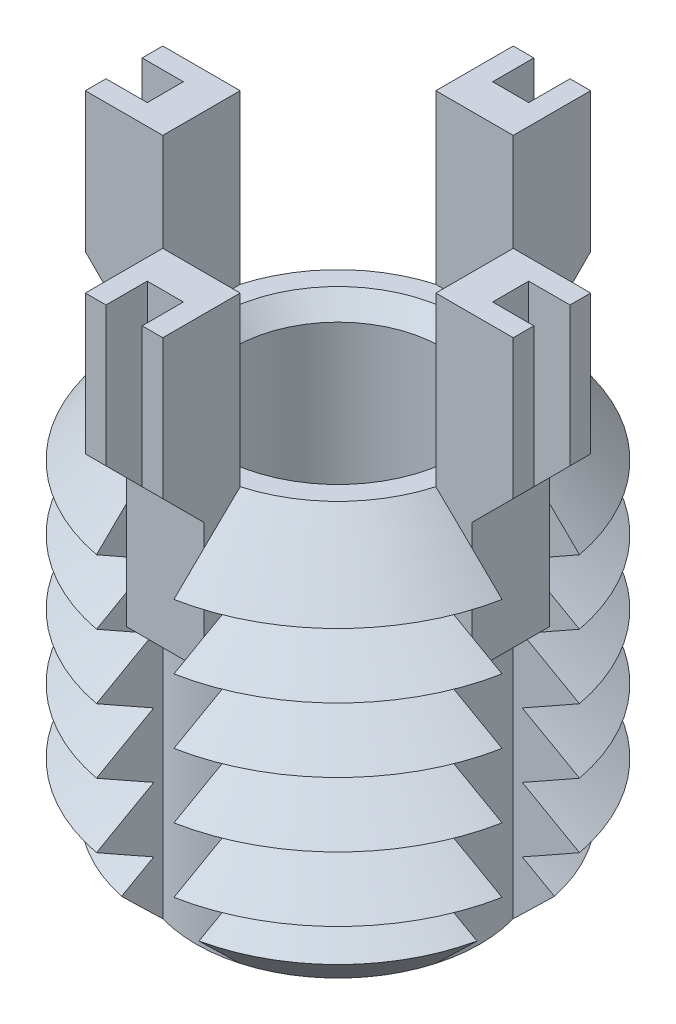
from build123d import *

# Parameters (mm, degrees)
SKETCH1_R               = 4
BOSS_EXTRUDE1_DEPTH     = 8
CHAMFER1_SIZE           = 1.25
LPATTERN1_COUNT         = 5
LPATTERN1_PITCH         = 1.25
CUT_EXTRUDE1_REACH      = 11.798
CIRPATTERN1_COUNT       = 4
BOSS_EXTRUDE3_DEPTH     = 0.75
CIRPATTERN2_COUNT       = 4
CUT_EXTRUDE3_DEPTH      = 13.68609506
CUT_EXTRUDE3_DEPTH_BACK = 13.68609506
SKETCH6_W               = 0.8
SKETCH6_H               = 0.7
SKETCH6_W_2             = 0.7
SKETCH6_H_2             = 0.8
SKETCH7_R               = 2
CUT_EXTRUDE4_DEPTH      = 8
CHAMFER2_SIZE           = 0.35


with BuildPart() as part:
    # Sketch1 → Boss-Extrude1 (new body)
    with BuildSketch(Plane(origin=(0, 0, 0), x_dir=(1, 0, 0), z_dir=(0, 1, 0))):
        with Locations(Location((0, 0, 0), (0, 0, 270))):
            Circle(SKETCH1_R)
    extrude(amount=-BOSS_EXTRUDE1_DEPTH)

    # Chamfer1
    chamfer1_edges = [part.edges().sort_by_distance(p)[0] for p in [
        (0, 0, -4),
        (0, -8, -4),
    ]]
    chamfer(chamfer1_edges, length=CHAMFER1_SIZE)

    # Sketch3 → Cut-Revolve1 (revolve, cut)
    with BuildSketch(Plane(origin=(0, 0, 0), x_dir=(0, 0, -1), z_dir=(1, 0, 0))):
        Polygon((-4, -1.25), (-2.917468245, -1.875), (-4, -2.5), align=None)
    cut_revolve1 = revolve(axis=Axis((0, 0.885892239, 0), (0, -1, 0)), mode=Mode.SUBTRACT)

    # LPattern1: Cut-Revolve1 ×5
    with Locations(*[(0, -i * LPATTERN1_PITCH, 0) for i in range(1, LPATTERN1_COUNT)]):
        add(cut_revolve1, mode=Mode.SUBTRACT)

    # Cut-Extrude1: up to this cone (the profile starts inside it)
    cut_extrude1_end = Plane(origin=(0, 0, 0), z_dir=(0, 1, 0)).offset(-10.749999) * Cone(1e-06, 33.798, 33.797999, align=(Align.CENTER, Align.CENTER, Align.MIN), mode=Mode.PRIVATE)
    # Sketch4 → Cut-Extrude1 (cut, up to the surface)
    with BuildSketch(Plane(origin=(0, 0, 0), x_dir=(1, 0, 0), z_dir=(0, 1, 0)), mode=Mode.PRIVATE) as cut_extrude1_sk1:
        with BuildLine():
            Line((-2.645751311, 0.75), (-3.929058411, 0.75))
            ThreePointArc((-3.929058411, 0.75), (-4, 0), (-3.929058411, -0.75))
            Line((-3.929058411, -0.75), (-2.645751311, -0.75))
            ThreePointArc((-2.645751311, -0.75), (-2.75, 0), (-2.645751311, 0.75))
        make_face()
    cut_extrude1_tool1 = extrude(cut_extrude1_sk1.sketch, amount=-CUT_EXTRUDE1_REACH, mode=Mode.PRIVATE) & cut_extrude1_end
    cut_extrude1 = cut_extrude1_tool1.solids().sort_by_distance((-3.345774, 0, 0))[0]
    add(cut_extrude1, mode=Mode.SUBTRACT)

    # CirPattern1: Cut-Extrude1 ×4 about axis
    cirpattern1_axis = Axis((0, 0, 0), (0, 1, 0))
    for i in range(1, CIRPATTERN1_COUNT):
        add(cut_extrude1.rotate(cirpattern1_axis, i * 360 / CIRPATTERN1_COUNT), mode=Mode.SUBTRACT)

    # Sketch5 → Boss-Extrude3 (add, symmetric)
    with BuildSketch(Plane(origin=(0, 0, 0), x_dir=(0, 0, -1), z_dir=(1, 0, 0))):
        Polygon((-2.645751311, 3.25), (-2.645751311, -2.75), (-3.345751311, -2.75), (-3.345751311, -0.25), (-4.145751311, 0.55), (-4.145751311, 3.25), align=None)
    boss_extrude3 = extrude(amount=BOSS_EXTRUDE3_DEPTH, both=True)

    # CirPattern2: Boss-Extrude3 ×4 about axis
    cirpattern2_axis = Axis((0, 0, 0), (0, 1, 0))
    for i in range(1, CIRPATTERN2_COUNT):
        add(boss_extrude3.rotate(cirpattern2_axis, i * 360 / CIRPATTERN2_COUNT))

    # Sketch6 → Cut-Extrude3 (cut, two sides: drawn at the far end of the back side and taken through both)
    with BuildSketch(Plane(origin=(0, 3.25, 0), x_dir=(1, 0, 0), z_dir=(0, 1, 0)).offset(-CUT_EXTRUDE3_DEPTH_BACK)):
        with Locations((-3.745751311, 0)):
            Rectangle(SKETCH6_W, SKETCH6_H)
        with Locations((0, 3.745751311)):
            Rectangle(SKETCH6_W_2, SKETCH6_H_2)
        with Locations((3.745751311, 0)):
            Rectangle(SKETCH6_W, SKETCH6_H)
        with Locations((0, -3.745751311)):
            Rectangle(SKETCH6_W_2, SKETCH6_H_2)
    extrude(amount=CUT_EXTRUDE3_DEPTH + CUT_EXTRUDE3_DEPTH_BACK, mode=Mode.SUBTRACT)

    # Sketch7 → Cut-Extrude4 (cut)
    with BuildSketch(Plane(origin=(0, 0, 0), x_dir=(1, 0, 0), z_dir=(0, 1, 0))):
        with Locations(Location((0, 0, 0), (0, 0, 270))):
            Circle(SKETCH7_R)
    extrude(amount=-CUT_EXTRUDE4_DEPTH, mode=Mode.SUBTRACT)

    # Chamfer2
    chamfer2_edges = [part.edges().sort_by_distance(p)[0] for p in [
        (0, 0, -2),
        (0, -8, -2),
    ]]
    chamfer(chamfer2_edges, length=CHAMFER2_SIZE)


solid = part.part
